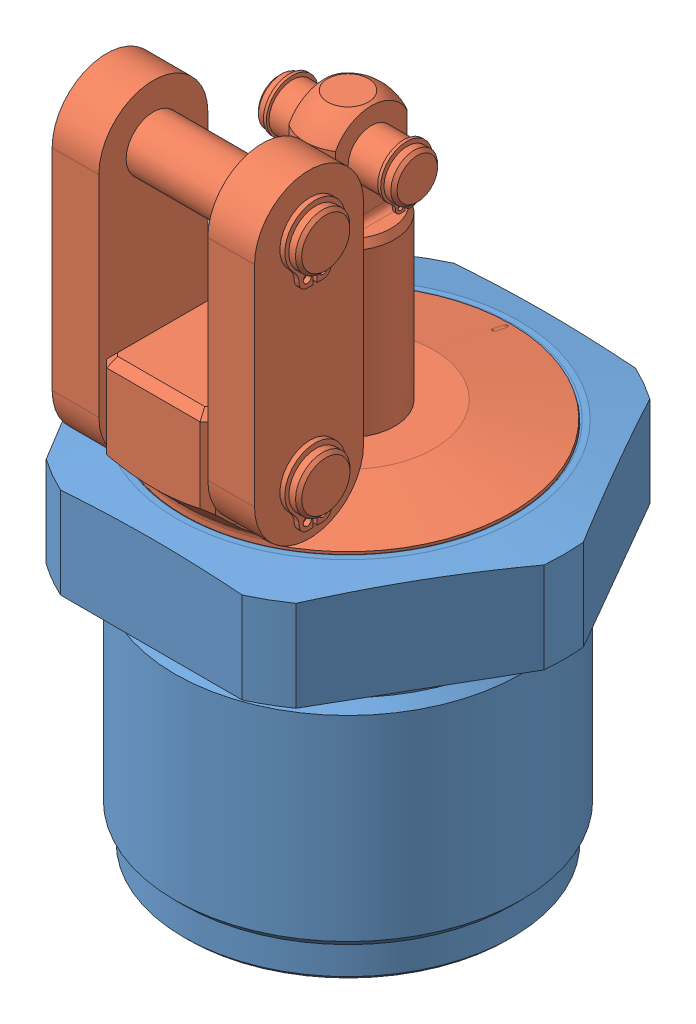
SolidWorks assembly ilcmv41621530.SLDASM, configuration Default (file format 13000). Lengths in mm.
Overall size (55.63 91.18 50.5).
2 component instances, 2 part files, 2 mates.
Components (placement in the parent):
- ilcmv41621530_BODY-1: ilcmv41621530_BODY.SLDPRT [Default] at (-55.626 4.1074 0.5103) size (55.63 47.9 50.5)
- ilcmv41621530_LUG-1: ilcmv41621530_LUG.SLDPRT [Default] at (-55.626 9.0858 0.5103) size (41.94 51 45.97)
Mates (geometry in assembly coordinates):
- Coincident1: coincident: plane of ilmv41621530_BODY-1 through (-34.6075 9.0858 0.5103) normal (0 1 0); plane of ilmv41621530_LUG-1 through (-62.6237 9.0858 0.5103) normal (0 -1 0)
- Concentric1: concentric anti-aligned: cylinder of ilmv41621530_BODY-1 through (-55.626 -4.8615 0.5103) axis (0 -1 0) radius 21.0185; cylinder of ilmv41621530_LUG-1 through (-55.626 25.7171 0.5103) axis (0 1 0) radius 20.9677
